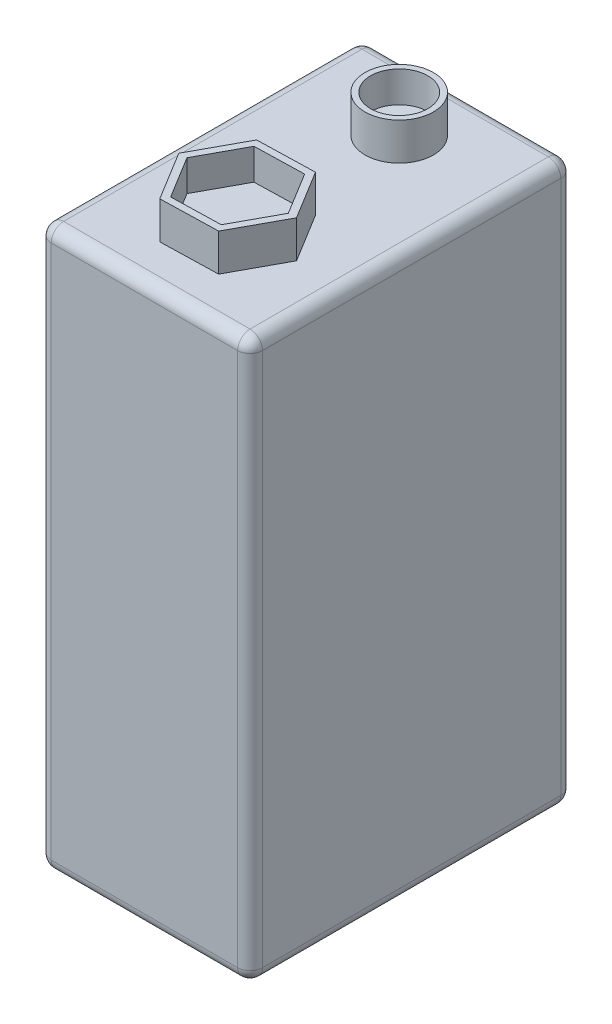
ISO-10303-21;
HEADER;
FILE_DESCRIPTION(('STEP AP214'),'2;1');
FILE_NAME('part.step','',(''),(''),'','','');
FILE_SCHEMA(('AUTOMOTIVE_DESIGN { 1 0 10303 214 1 1 1 1 }'));
ENDSEC;
DATA;
#1=APPLICATION_CONTEXT('core data for automotive mechanical design processes');
#2=APPLICATION_PROTOCOL_DEFINITION('international standard','automotive_design',2000,#1);
#3=PRODUCT_CONTEXT('',#1,'mechanical');
#4=PRODUCT('Part','Part','',(#3));
#5=PRODUCT_RELATED_PRODUCT_CATEGORY('part','',(#4));
#6=PRODUCT_DEFINITION_FORMATION('','',#4);
#7=PRODUCT_DEFINITION_CONTEXT('part definition',#1,'design');
#8=PRODUCT_DEFINITION('design','',#6,#7);
#9=PRODUCT_DEFINITION_SHAPE('','',#8);
#10=(LENGTH_UNIT() NAMED_UNIT(*) SI_UNIT(.MILLI.,.METRE.));
#11=(NAMED_UNIT(*) PLANE_ANGLE_UNIT() SI_UNIT($,.RADIAN.));
#12=(NAMED_UNIT(*) SI_UNIT($,.STERADIAN.) SOLID_ANGLE_UNIT());
#13=UNCERTAINTY_MEASURE_WITH_UNIT(LENGTH_MEASURE(1.E-05),#10,'distance_accuracy_value','');
#14=(GEOMETRIC_REPRESENTATION_CONTEXT(3) GLOBAL_UNCERTAINTY_ASSIGNED_CONTEXT((#13)) GLOBAL_UNIT_ASSIGNED_CONTEXT((#10,
#11,#12)) REPRESENTATION_CONTEXT('',''));
#15=CARTESIAN_POINT('',(0.,0.,0.));
#16=DIRECTION('',(0.,0.,1.));
#17=DIRECTION('',(1.,0.,0.));
#18=AXIS2_PLACEMENT_3D('',#15,#16,#17);
#19=CARTESIAN_POINT('',(0.,45.,26.));
#20=DIRECTION('',(0.,1.,0.));
#21=DIRECTION('',(0.,0.,1.));
#22=AXIS2_PLACEMENT_3D('',#19,#20,#21);
#23=PLANE('',#22);
#24=CARTESIAN_POINT('',(8.5,45.,5.5));
#25=DIRECTION('',(0.,1.,0.));
#26=DIRECTION('',(0.,0.,1.));
#27=AXIS2_PLACEMENT_3D('',#24,#25,#26);
#28=CIRCLE('',#27,2.75);
#29=CARTESIAN_POINT('',(8.5,45.,8.25));
#30=VERTEX_POINT('',#29);
#31=EDGE_CURVE('E292',#30,#30,#28,.T.);
#32=ORIENTED_EDGE('',*,*,#31,.F.);
#33=EDGE_LOOP('',(#32));
#34=FACE_BOUND('',#33,.T.);
#35=DIRECTION('',(1.,0.,0.));
#36=VECTOR('',#35,1.);
#37=CARTESIAN_POINT('',(16.,45.,25.));
#38=LINE('',#37,#36);
#39=CARTESIAN_POINT('',(1.,45.,25.));
#40=VERTEX_POINT('',#39);
#41=CARTESIAN_POINT('',(16.,45.,25.));
#42=VERTEX_POINT('',#41);
#43=EDGE_CURVE('E399',#40,#42,#38,.T.);
#44=ORIENTED_EDGE('',*,*,#43,.T.);
#45=DIRECTION('',(0.,0.,-1.));
#46=VECTOR('',#45,1.);
#47=CARTESIAN_POINT('',(16.,45.,1.));
#48=LINE('',#47,#46);
#49=CARTESIAN_POINT('',(16.,45.,1.));
#50=VERTEX_POINT('',#49);
#51=EDGE_CURVE('E401',#42,#50,#48,.T.);
#52=ORIENTED_EDGE('',*,*,#51,.T.);
#53=DIRECTION('',(-1.,0.,0.));
#54=VECTOR('',#53,1.);
#55=CARTESIAN_POINT('',(1.,45.,1.));
#56=LINE('',#55,#54);
#57=CARTESIAN_POINT('',(1.,45.,1.));
#58=VERTEX_POINT('',#57);
#59=EDGE_CURVE('E395',#50,#58,#56,.T.);
#60=ORIENTED_EDGE('',*,*,#59,.T.);
#61=DIRECTION('',(0.,0.,1.));
#62=VECTOR('',#61,1.);
#63=CARTESIAN_POINT('',(1.,45.,25.));
#64=LINE('',#63,#62);
#65=EDGE_CURVE('E397',#58,#40,#64,.T.);
#66=ORIENTED_EDGE('',*,*,#65,.T.);
#67=EDGE_LOOP('',(#44,#52,#60,#66));
#68=FACE_BOUND('',#67,.T.);
#69=DIRECTION('',(0.477175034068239,0.,-0.878808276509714));
#70=VECTOR('',#69,1.);
#71=CARTESIAN_POINT('',(10.9132445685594,45.,22.4382209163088));
#72=LINE('',#71,#70);
#73=CARTESIAN_POINT('',(10.9132445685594,45.,22.4382209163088));
#74=VERTEX_POINT('',#73);
#75=CARTESIAN_POINT('',(13.1172216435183,45.,18.3791793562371));
#76=VERTEX_POINT('',#75);
#77=EDGE_CURVE('E254',#74,#76,#72,.T.);
#78=ORIENTED_EDGE('',*,*,#77,.F.);
#79=DIRECTION('',(0.999657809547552,0.,-0.0261584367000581));
#80=VECTOR('',#79,1.);
#81=CARTESIAN_POINT('',(6.29602292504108,45.,22.5590415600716));
#82=LINE('',#81,#80);
#83=CARTESIAN_POINT('',(6.29602292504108,45.,22.5590415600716));
#84=VERTEX_POINT('',#83);
#85=EDGE_CURVE('E245',#84,#74,#82,.T.);
#86=ORIENTED_EDGE('',*,*,#85,.F.);
#87=DIRECTION('',(0.522482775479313,0.,0.852649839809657));
#88=VECTOR('',#87,1.);
#89=CARTESIAN_POINT('',(3.88277835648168,45.,18.6208206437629));
#90=LINE('',#89,#88);
#91=CARTESIAN_POINT('',(3.88277835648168,45.,18.6208206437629));
#92=VERTEX_POINT('',#91);
#93=EDGE_CURVE('E262',#92,#84,#90,.T.);
#94=ORIENTED_EDGE('',*,*,#93,.F.);
#95=DIRECTION('',(-0.477175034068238,0.,0.878808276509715));
#96=VECTOR('',#95,1.);
#97=CARTESIAN_POINT('',(6.08675543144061,45.,14.5617790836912));
#98=LINE('',#97,#96);
#99=CARTESIAN_POINT('',(6.08675543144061,45.,14.5617790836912));
#100=VERTEX_POINT('',#99);
#101=EDGE_CURVE('E260',#100,#92,#98,.T.);
#102=ORIENTED_EDGE('',*,*,#101,.F.);
#103=DIRECTION('',(-0.999657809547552,0.,0.0261584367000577));
#104=VECTOR('',#103,1.);
#105=CARTESIAN_POINT('',(10.7039770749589,45.,14.4409584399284));
#106=LINE('',#105,#104);
#107=CARTESIAN_POINT('',(10.7039770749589,45.,14.4409584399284));
#108=VERTEX_POINT('',#107);
#109=EDGE_CURVE('E258',#108,#100,#106,.T.);
#110=ORIENTED_EDGE('',*,*,#109,.F.);
#111=DIRECTION('',(-0.522482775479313,0.,-0.852649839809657));
#112=VECTOR('',#111,1.);
#113=CARTESIAN_POINT('',(13.1172216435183,45.,18.3791793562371));
#114=LINE('',#113,#112);
#115=EDGE_CURVE('E256',#76,#108,#114,.T.);
#116=ORIENTED_EDGE('',*,*,#115,.F.);
#117=EDGE_LOOP('',(#78,#86,#94,#102,#110,#116));
#118=FACE_BOUND('',#117,.T.);
#119=ADVANCED_FACE('F33',(#34,#68,#118),#23,.T.);
#120=CARTESIAN_POINT('',(0.,45.,0.));
#121=DIRECTION('',(1.,0.,0.));
#122=DIRECTION('',(0.,0.,-1.));
#123=AXIS2_PLACEMENT_3D('',#120,#121,#122);
#124=PLANE('',#123);
#125=DIRECTION('',(0.,-1.,0.));
#126=VECTOR('',#125,1.);
#127=CARTESIAN_POINT('',(0.,45.,25.));
#128=LINE('',#127,#126);
#129=CARTESIAN_POINT('',(0.,1.,25.));
#130=VERTEX_POINT('',#129);
#131=CARTESIAN_POINT('',(0.,44.,25.));
#132=VERTEX_POINT('',#131);
#133=EDGE_CURVE('E348',#130,#132,#128,.F.);
#134=ORIENTED_EDGE('',*,*,#133,.T.);
#135=DIRECTION('',(0.,0.,1.));
#136=VECTOR('',#135,1.);
#137=CARTESIAN_POINT('',(0.,44.,1.));
#138=LINE('',#137,#136);
#139=CARTESIAN_POINT('',(0.,44.,1.));
#140=VERTEX_POINT('',#139);
#141=EDGE_CURVE('E412',#132,#140,#138,.F.);
#142=ORIENTED_EDGE('',*,*,#141,.T.);
#143=DIRECTION('',(0.,-1.,0.));
#144=VECTOR('',#143,1.);
#145=CARTESIAN_POINT('',(0.,45.,1.));
#146=LINE('',#145,#144);
#147=CARTESIAN_POINT('',(0.,1.,1.));
#148=VERTEX_POINT('',#147);
#149=EDGE_CURVE('E358',#140,#148,#146,.T.);
#150=ORIENTED_EDGE('',*,*,#149,.T.);
#151=DIRECTION('',(0.,0.,1.));
#152=VECTOR('',#151,1.);
#153=CARTESIAN_POINT('',(0.,1.,0.));
#154=LINE('',#153,#152);
#155=EDGE_CURVE('E390',#148,#130,#154,.T.);
#156=ORIENTED_EDGE('',*,*,#155,.T.);
#157=EDGE_LOOP('',(#134,#142,#150,#156));
#158=FACE_BOUND('',#157,.T.);
#159=ADVANCED_FACE('F35',(#158),#124,.F.);
#160=CARTESIAN_POINT('',(0.,45.,26.));
#161=DIRECTION('',(0.,0.,-1.));
#162=DIRECTION('',(-1.,0.,0.));
#163=AXIS2_PLACEMENT_3D('',#160,#161,#162);
#164=PLANE('',#163);
#165=DIRECTION('',(0.,-1.,0.));
#166=VECTOR('',#165,1.);
#167=CARTESIAN_POINT('',(16.,45.,26.));
#168=LINE('',#167,#166);
#169=CARTESIAN_POINT('',(16.,1.,26.));
#170=VERTEX_POINT('',#169);
#171=CARTESIAN_POINT('',(16.,44.,26.));
#172=VERTEX_POINT('',#171);
#173=EDGE_CURVE('E343',#170,#172,#168,.F.);
#174=ORIENTED_EDGE('',*,*,#173,.T.);
#175=DIRECTION('',(1.,0.,0.));
#176=VECTOR('',#175,1.);
#177=CARTESIAN_POINT('',(1.,44.,26.));
#178=LINE('',#177,#176);
#179=CARTESIAN_POINT('',(1.,44.,26.));
#180=VERTEX_POINT('',#179);
#181=EDGE_CURVE('E408',#172,#180,#178,.F.);
#182=ORIENTED_EDGE('',*,*,#181,.T.);
#183=DIRECTION('',(0.,-1.,0.));
#184=VECTOR('',#183,1.);
#185=CARTESIAN_POINT('',(1.,45.,26.));
#186=LINE('',#185,#184);
#187=CARTESIAN_POINT('',(1.,1.,26.));
#188=VERTEX_POINT('',#187);
#189=EDGE_CURVE('E346',#180,#188,#186,.T.);
#190=ORIENTED_EDGE('',*,*,#189,.T.);
#191=DIRECTION('',(1.,0.,0.));
#192=VECTOR('',#191,1.);
#193=CARTESIAN_POINT('',(0.,1.,26.));
#194=LINE('',#193,#192);
#195=EDGE_CURVE('E366',#188,#170,#194,.T.);
#196=ORIENTED_EDGE('',*,*,#195,.T.);
#197=EDGE_LOOP('',(#174,#182,#190,#196));
#198=FACE_BOUND('',#197,.T.);
#199=ADVANCED_FACE('F486',(#198),#164,.F.);
#200=CARTESIAN_POINT('',(17.,45.,0.));
#201=DIRECTION('',(-1.,0.,0.));
#202=DIRECTION('',(0.,0.,1.));
#203=AXIS2_PLACEMENT_3D('',#200,#201,#202);
#204=PLANE('',#203);
#205=DIRECTION('',(0.,-1.,0.));
#206=VECTOR('',#205,1.);
#207=CARTESIAN_POINT('',(17.,45.,1.));
#208=LINE('',#207,#206);
#209=CARTESIAN_POINT('',(17.,1.,1.));
#210=VERTEX_POINT('',#209);
#211=CARTESIAN_POINT('',(17.,44.,1.));
#212=VERTEX_POINT('',#211);
#213=EDGE_CURVE('E351',#210,#212,#208,.F.);
#214=ORIENTED_EDGE('',*,*,#213,.T.);
#215=DIRECTION('',(0.,0.,-1.));
#216=VECTOR('',#215,1.);
#217=CARTESIAN_POINT('',(17.,44.,25.));
#218=LINE('',#217,#216);
#219=CARTESIAN_POINT('',(17.,44.,25.));
#220=VERTEX_POINT('',#219);
#221=EDGE_CURVE('E404',#212,#220,#218,.F.);
#222=ORIENTED_EDGE('',*,*,#221,.T.);
#223=DIRECTION('',(0.,-1.,0.));
#224=VECTOR('',#223,1.);
#225=CARTESIAN_POINT('',(17.,45.,25.));
#226=LINE('',#225,#224);
#227=CARTESIAN_POINT('',(17.,1.,25.));
#228=VERTEX_POINT('',#227);
#229=EDGE_CURVE('E354',#220,#228,#226,.T.);
#230=ORIENTED_EDGE('',*,*,#229,.T.);
#231=DIRECTION('',(0.,0.,-1.));
#232=VECTOR('',#231,1.);
#233=CARTESIAN_POINT('',(17.,1.,0.));
#234=LINE('',#233,#232);
#235=EDGE_CURVE('E380',#228,#210,#234,.T.);
#236=ORIENTED_EDGE('',*,*,#235,.T.);
#237=EDGE_LOOP('',(#214,#222,#230,#236));
#238=FACE_BOUND('',#237,.T.);
#239=ADVANCED_FACE('F447',(#238),#204,.F.);
#240=CARTESIAN_POINT('',(0.,45.,0.));
#241=DIRECTION('',(0.,0.,1.));
#242=DIRECTION('',(1.,0.,0.));
#243=AXIS2_PLACEMENT_3D('',#240,#241,#242);
#244=PLANE('',#243);
#245=DIRECTION('',(0.,-1.,0.));
#246=VECTOR('',#245,1.);
#247=CARTESIAN_POINT('',(1.,45.,0.));
#248=LINE('',#247,#246);
#249=CARTESIAN_POINT('',(1.,1.,0.));
#250=VERTEX_POINT('',#249);
#251=CARTESIAN_POINT('',(1.,44.,0.));
#252=VERTEX_POINT('',#251);
#253=EDGE_CURVE('E360',#250,#252,#248,.F.);
#254=ORIENTED_EDGE('',*,*,#253,.T.);
#255=DIRECTION('',(-1.,0.,0.));
#256=VECTOR('',#255,1.);
#257=CARTESIAN_POINT('',(16.,44.,0.));
#258=LINE('',#257,#256);
#259=CARTESIAN_POINT('',(16.,44.,0.));
#260=VERTEX_POINT('',#259);
#261=EDGE_CURVE('E11',#252,#260,#258,.F.);
#262=ORIENTED_EDGE('',*,*,#261,.T.);
#263=DIRECTION('',(0.,-1.,0.));
#264=VECTOR('',#263,1.);
#265=CARTESIAN_POINT('',(16.,45.,0.));
#266=LINE('',#265,#264);
#267=CARTESIAN_POINT('',(16.,1.,0.));
#268=VERTEX_POINT('',#267);
#269=EDGE_CURVE('E356',#260,#268,#266,.T.);
#270=ORIENTED_EDGE('',*,*,#269,.T.);
#271=DIRECTION('',(-1.,0.,0.));
#272=VECTOR('',#271,1.);
#273=CARTESIAN_POINT('',(0.,1.,0.));
#274=LINE('',#273,#272);
#275=EDGE_CURVE('E385',#268,#250,#274,.T.);
#276=ORIENTED_EDGE('',*,*,#275,.T.);
#277=EDGE_LOOP('',(#254,#262,#270,#276));
#278=FACE_BOUND('',#277,.T.);
#279=ADVANCED_FACE('F423',(#278),#244,.F.);
#280=CARTESIAN_POINT('',(0.,0.,26.));
#281=DIRECTION('',(0.,1.,0.));
#282=DIRECTION('',(0.,0.,1.));
#283=AXIS2_PLACEMENT_3D('',#280,#281,#282);
#284=PLANE('',#283);
#285=DIRECTION('',(0.,0.,-1.));
#286=VECTOR('',#285,1.);
#287=CARTESIAN_POINT('',(16.,0.,26.));
#288=LINE('',#287,#286);
#289=CARTESIAN_POINT('',(16.,0.,1.));
#290=VERTEX_POINT('',#289);
#291=CARTESIAN_POINT('',(16.,0.,25.));
#292=VERTEX_POINT('',#291);
#293=EDGE_CURVE('E372',#290,#292,#288,.F.);
#294=ORIENTED_EDGE('',*,*,#293,.T.);
#295=DIRECTION('',(1.,0.,0.));
#296=VECTOR('',#295,1.);
#297=CARTESIAN_POINT('',(0.,0.,25.));
#298=LINE('',#297,#296);
#299=CARTESIAN_POINT('',(1.,0.,25.));
#300=VERTEX_POINT('',#299);
#301=EDGE_CURVE('E374',#292,#300,#298,.F.);
#302=ORIENTED_EDGE('',*,*,#301,.T.);
#303=DIRECTION('',(0.,0.,1.));
#304=VECTOR('',#303,1.);
#305=CARTESIAN_POINT('',(1.,0.,26.));
#306=LINE('',#305,#304);
#307=CARTESIAN_POINT('',(1.,0.,1.));
#308=VERTEX_POINT('',#307);
#309=EDGE_CURVE('E368',#300,#308,#306,.F.);
#310=ORIENTED_EDGE('',*,*,#309,.T.);
#311=DIRECTION('',(-1.,0.,0.));
#312=VECTOR('',#311,1.);
#313=CARTESIAN_POINT('',(0.,0.,1.));
#314=LINE('',#313,#312);
#315=EDGE_CURVE('E370',#308,#290,#314,.F.);
#316=ORIENTED_EDGE('',*,*,#315,.T.);
#317=EDGE_LOOP('',(#294,#302,#310,#316));
#318=FACE_BOUND('',#317,.T.);
#319=ADVANCED_FACE('F465',(#318),#284,.F.);
#320=CARTESIAN_POINT('',(1.,45.,25.));
#321=DIRECTION('',(0.,-1.,0.));
#322=DIRECTION('',(0.,0.,-1.));
#323=AXIS2_PLACEMENT_3D('',#320,#321,#322);
#324=CYLINDRICAL_SURFACE('',#323,1.);
#325=ORIENTED_EDGE('',*,*,#189,.F.);
#326=CARTESIAN_POINT('',(1.,44.,25.));
#327=DIRECTION('',(0.,-1.,0.));
#328=DIRECTION('',(0.,0.,-1.));
#329=AXIS2_PLACEMENT_3D('',#326,#327,#328);
#330=CIRCLE('',#329,1.);
#331=EDGE_CURVE('E410',#180,#132,#330,.T.);
#332=ORIENTED_EDGE('',*,*,#331,.T.);
#333=ORIENTED_EDGE('',*,*,#133,.F.);
#334=CARTESIAN_POINT('',(1.,1.,25.));
#335=DIRECTION('',(0.,-1.,0.));
#336=DIRECTION('',(0.,0.,-1.));
#337=AXIS2_PLACEMENT_3D('',#334,#335,#336);
#338=CIRCLE('',#337,1.);
#339=EDGE_CURVE('E363',#130,#188,#338,.F.);
#340=ORIENTED_EDGE('',*,*,#339,.T.);
#341=EDGE_LOOP('',(#325,#332,#333,#340));
#342=FACE_BOUND('',#341,.T.);
#343=ADVANCED_FACE('F514',(#342),#324,.T.);
#344=CARTESIAN_POINT('',(16.,45.,25.));
#345=DIRECTION('',(0.,-1.,0.));
#346=DIRECTION('',(0.,0.,-1.));
#347=AXIS2_PLACEMENT_3D('',#344,#345,#346);
#348=CYLINDRICAL_SURFACE('',#347,1.);
#349=ORIENTED_EDGE('',*,*,#229,.F.);
#350=CARTESIAN_POINT('',(16.,44.,25.));
#351=DIRECTION('',(0.,-1.,0.));
#352=DIRECTION('',(0.,0.,-1.));
#353=AXIS2_PLACEMENT_3D('',#350,#351,#352);
#354=CIRCLE('',#353,1.);
#355=EDGE_CURVE('E406',#220,#172,#354,.T.);
#356=ORIENTED_EDGE('',*,*,#355,.T.);
#357=ORIENTED_EDGE('',*,*,#173,.F.);
#358=CARTESIAN_POINT('',(16.,1.,25.));
#359=DIRECTION('',(0.,-1.,0.));
#360=DIRECTION('',(0.,0.,-1.));
#361=AXIS2_PLACEMENT_3D('',#358,#359,#360);
#362=CIRCLE('',#361,1.);
#363=EDGE_CURVE('E377',#170,#228,#362,.F.);
#364=ORIENTED_EDGE('',*,*,#363,.T.);
#365=EDGE_LOOP('',(#349,#356,#357,#364));
#366=FACE_BOUND('',#365,.T.);
#367=ADVANCED_FACE('F513',(#366),#348,.T.);
#368=CARTESIAN_POINT('',(16.,45.,1.));
#369=DIRECTION('',(0.,-1.,0.));
#370=DIRECTION('',(0.,0.,-1.));
#371=AXIS2_PLACEMENT_3D('',#368,#369,#370);
#372=CYLINDRICAL_SURFACE('',#371,1.);
#373=ORIENTED_EDGE('',*,*,#269,.F.);
#374=CARTESIAN_POINT('',(16.,44.,1.));
#375=DIRECTION('',(0.,-1.,0.));
#376=DIRECTION('',(0.,0.,-1.));
#377=AXIS2_PLACEMENT_3D('',#374,#375,#376);
#378=CIRCLE('',#377,1.);
#379=EDGE_CURVE('E392',#260,#212,#378,.T.);
#380=ORIENTED_EDGE('',*,*,#379,.T.);
#381=ORIENTED_EDGE('',*,*,#213,.F.);
#382=CARTESIAN_POINT('',(16.,1.,1.));
#383=DIRECTION('',(0.,-1.,0.));
#384=DIRECTION('',(0.,0.,-1.));
#385=AXIS2_PLACEMENT_3D('',#382,#383,#384);
#386=CIRCLE('',#385,1.);
#387=EDGE_CURVE('E382',#210,#268,#386,.F.);
#388=ORIENTED_EDGE('',*,*,#387,.T.);
#389=EDGE_LOOP('',(#373,#380,#381,#388));
#390=FACE_BOUND('',#389,.T.);
#391=ADVANCED_FACE('F445',(#390),#372,.T.);
#392=CARTESIAN_POINT('',(1.,45.,1.));
#393=DIRECTION('',(0.,-1.,0.));
#394=DIRECTION('',(0.,0.,-1.));
#395=AXIS2_PLACEMENT_3D('',#392,#393,#394);
#396=CYLINDRICAL_SURFACE('',#395,1.);
#397=ORIENTED_EDGE('',*,*,#149,.F.);
#398=CARTESIAN_POINT('',(1.,44.,1.));
#399=DIRECTION('',(0.,-1.,0.));
#400=DIRECTION('',(0.,0.,-1.));
#401=AXIS2_PLACEMENT_3D('',#398,#399,#400);
#402=CIRCLE('',#401,1.);
#403=EDGE_CURVE('E41',#140,#252,#402,.T.);
#404=ORIENTED_EDGE('',*,*,#403,.T.);
#405=ORIENTED_EDGE('',*,*,#253,.F.);
#406=CARTESIAN_POINT('',(1.,1.,1.));
#407=DIRECTION('',(0.,-1.,0.));
#408=DIRECTION('',(0.,0.,-1.));
#409=AXIS2_PLACEMENT_3D('',#406,#407,#408);
#410=CIRCLE('',#409,1.);
#411=EDGE_CURVE('E387',#250,#148,#410,.F.);
#412=ORIENTED_EDGE('',*,*,#411,.T.);
#413=EDGE_LOOP('',(#397,#404,#405,#412));
#414=FACE_BOUND('',#413,.T.);
#415=ADVANCED_FACE('F417',(#414),#396,.T.);
#416=CARTESIAN_POINT('',(16.,1.,1.));
#417=DIRECTION('',(0.,0.,1.));
#418=DIRECTION('',(1.,0.,0.));
#419=AXIS2_PLACEMENT_3D('',#416,#417,#418);
#420=SPHERICAL_SURFACE('',#419,1.);
#421=CARTESIAN_POINT('',(16.,1.,1.));
#422=DIRECTION('',(-1.,0.,0.));
#423=DIRECTION('',(0.,0.,1.));
#424=AXIS2_PLACEMENT_3D('',#421,#422,#423);
#425=CIRCLE('',#424,1.);
#426=EDGE_CURVE('E337',#268,#290,#425,.T.);
#427=ORIENTED_EDGE('',*,*,#426,.F.);
#428=ORIENTED_EDGE('',*,*,#387,.F.);
#429=CARTESIAN_POINT('',(16.,1.,1.));
#430=DIRECTION('',(0.,0.,1.));
#431=DIRECTION('',(1.,0.,0.));
#432=AXIS2_PLACEMENT_3D('',#429,#430,#431);
#433=CIRCLE('',#432,1.);
#434=EDGE_CURVE('E340',#290,#210,#433,.T.);
#435=ORIENTED_EDGE('',*,*,#434,.F.);
#436=EDGE_LOOP('',(#427,#428,#435));
#437=FACE_BOUND('',#436,.T.);
#438=ADVANCED_FACE('F471',(#437),#420,.T.);
#439=CARTESIAN_POINT('',(16.,1.,0.));
#440=DIRECTION('',(0.,0.,-1.));
#441=DIRECTION('',(-1.,0.,0.));
#442=AXIS2_PLACEMENT_3D('',#439,#440,#441);
#443=CYLINDRICAL_SURFACE('',#442,1.);
#444=ORIENTED_EDGE('',*,*,#434,.T.);
#445=ORIENTED_EDGE('',*,*,#235,.F.);
#446=CARTESIAN_POINT('',(16.,1.,25.));
#447=DIRECTION('',(0.,0.,1.));
#448=DIRECTION('',(1.,0.,0.));
#449=AXIS2_PLACEMENT_3D('',#446,#447,#448);
#450=CIRCLE('',#449,1.);
#451=EDGE_CURVE('E334',#292,#228,#450,.T.);
#452=ORIENTED_EDGE('',*,*,#451,.F.);
#453=ORIENTED_EDGE('',*,*,#293,.F.);
#454=EDGE_LOOP('',(#444,#445,#452,#453));
#455=FACE_BOUND('',#454,.T.);
#456=ADVANCED_FACE('F451',(#455),#443,.T.);
#457=CARTESIAN_POINT('',(0.,1.,1.));
#458=DIRECTION('',(-1.,0.,0.));
#459=DIRECTION('',(0.,0.,1.));
#460=AXIS2_PLACEMENT_3D('',#457,#458,#459);
#461=CYLINDRICAL_SURFACE('',#460,1.);
#462=ORIENTED_EDGE('',*,*,#426,.T.);
#463=ORIENTED_EDGE('',*,*,#315,.F.);
#464=CARTESIAN_POINT('',(1.,1.,1.));
#465=DIRECTION('',(-1.,0.,0.));
#466=DIRECTION('',(0.,0.,1.));
#467=AXIS2_PLACEMENT_3D('',#464,#465,#466);
#468=CIRCLE('',#467,1.);
#469=EDGE_CURVE('E331',#250,#308,#468,.T.);
#470=ORIENTED_EDGE('',*,*,#469,.F.);
#471=ORIENTED_EDGE('',*,*,#275,.F.);
#472=EDGE_LOOP('',(#462,#463,#470,#471));
#473=FACE_BOUND('',#472,.T.);
#474=ADVANCED_FACE('F469',(#473),#461,.T.);
#475=CARTESIAN_POINT('',(16.,1.,25.));
#476=DIRECTION('',(0.,0.,1.));
#477=DIRECTION('',(1.,0.,0.));
#478=AXIS2_PLACEMENT_3D('',#475,#476,#477);
#479=SPHERICAL_SURFACE('',#478,1.);
#480=ORIENTED_EDGE('',*,*,#451,.T.);
#481=ORIENTED_EDGE('',*,*,#363,.F.);
#482=CARTESIAN_POINT('',(16.,1.,25.));
#483=DIRECTION('',(-1.,0.,0.));
#484=DIRECTION('',(0.,0.,1.));
#485=AXIS2_PLACEMENT_3D('',#482,#483,#484);
#486=CIRCLE('',#485,1.);
#487=EDGE_CURVE('E328',#292,#170,#486,.T.);
#488=ORIENTED_EDGE('',*,*,#487,.F.);
#489=EDGE_LOOP('',(#480,#481,#488));
#490=FACE_BOUND('',#489,.T.);
#491=ADVANCED_FACE('F457',(#490),#479,.T.);
#492=CARTESIAN_POINT('',(1.,1.,1.));
#493=DIRECTION('',(0.,0.,1.));
#494=DIRECTION('',(1.,0.,0.));
#495=AXIS2_PLACEMENT_3D('',#492,#493,#494);
#496=SPHERICAL_SURFACE('',#495,1.);
#497=ORIENTED_EDGE('',*,*,#411,.F.);
#498=ORIENTED_EDGE('',*,*,#469,.T.);
#499=CARTESIAN_POINT('',(1.,1.,1.));
#500=DIRECTION('',(0.,0.,1.));
#501=DIRECTION('',(1.,0.,0.));
#502=AXIS2_PLACEMENT_3D('',#499,#500,#501);
#503=CIRCLE('',#502,1.);
#504=EDGE_CURVE('E325',#148,#308,#503,.T.);
#505=ORIENTED_EDGE('',*,*,#504,.F.);
#506=EDGE_LOOP('',(#497,#498,#505));
#507=FACE_BOUND('',#506,.T.);
#508=ADVANCED_FACE('F544',(#507),#496,.T.);
#509=CARTESIAN_POINT('',(0.,1.,25.));
#510=DIRECTION('',(1.,0.,0.));
#511=DIRECTION('',(0.,0.,-1.));
#512=AXIS2_PLACEMENT_3D('',#509,#510,#511);
#513=CYLINDRICAL_SURFACE('',#512,1.);
#514=ORIENTED_EDGE('',*,*,#487,.T.);
#515=ORIENTED_EDGE('',*,*,#195,.F.);
#516=CARTESIAN_POINT('',(1.,1.,25.));
#517=DIRECTION('',(-1.,0.,0.));
#518=DIRECTION('',(0.,0.,1.));
#519=AXIS2_PLACEMENT_3D('',#516,#517,#518);
#520=CIRCLE('',#519,1.);
#521=EDGE_CURVE('E322',#300,#188,#520,.T.);
#522=ORIENTED_EDGE('',*,*,#521,.F.);
#523=ORIENTED_EDGE('',*,*,#301,.F.);
#524=EDGE_LOOP('',(#514,#515,#522,#523));
#525=FACE_BOUND('',#524,.T.);
#526=ADVANCED_FACE('F462',(#525),#513,.T.);
#527=CARTESIAN_POINT('',(1.,1.,0.));
#528=DIRECTION('',(0.,0.,1.));
#529=DIRECTION('',(1.,0.,0.));
#530=AXIS2_PLACEMENT_3D('',#527,#528,#529);
#531=CYLINDRICAL_SURFACE('',#530,1.);
#532=ORIENTED_EDGE('',*,*,#504,.T.);
#533=ORIENTED_EDGE('',*,*,#309,.F.);
#534=CARTESIAN_POINT('',(1.,1.,25.));
#535=DIRECTION('',(0.,0.,1.));
#536=DIRECTION('',(1.,0.,0.));
#537=AXIS2_PLACEMENT_3D('',#534,#535,#536);
#538=CIRCLE('',#537,1.);
#539=EDGE_CURVE('E320',#130,#300,#538,.T.);
#540=ORIENTED_EDGE('',*,*,#539,.F.);
#541=ORIENTED_EDGE('',*,*,#155,.F.);
#542=EDGE_LOOP('',(#532,#533,#540,#541));
#543=FACE_BOUND('',#542,.T.);
#544=ADVANCED_FACE('F540',(#543),#531,.T.);
#545=CARTESIAN_POINT('',(1.,1.,25.));
#546=DIRECTION('',(0.,0.,1.));
#547=DIRECTION('',(1.,0.,0.));
#548=AXIS2_PLACEMENT_3D('',#545,#546,#547);
#549=SPHERICAL_SURFACE('',#548,1.);
#550=ORIENTED_EDGE('',*,*,#521,.T.);
#551=ORIENTED_EDGE('',*,*,#339,.F.);
#552=ORIENTED_EDGE('',*,*,#539,.T.);
#553=EDGE_LOOP('',(#550,#551,#552));
#554=FACE_BOUND('',#553,.T.);
#555=ADVANCED_FACE('F538',(#554),#549,.T.);
#556=CARTESIAN_POINT('',(1.,44.,25.));
#557=DIRECTION('',(0.,0.,1.));
#558=DIRECTION('',(1.,0.,0.));
#559=AXIS2_PLACEMENT_3D('',#556,#557,#558);
#560=SPHERICAL_SURFACE('',#559,1.);
#561=CARTESIAN_POINT('',(1.,44.,25.));
#562=DIRECTION('',(0.,0.,-1.));
#563=DIRECTION('',(-1.,0.,0.));
#564=AXIS2_PLACEMENT_3D('',#561,#562,#563);
#565=CIRCLE('',#564,1.);
#566=EDGE_CURVE('E314',#132,#40,#565,.T.);
#567=ORIENTED_EDGE('',*,*,#566,.F.);
#568=ORIENTED_EDGE('',*,*,#331,.F.);
#569=CARTESIAN_POINT('',(1.,44.,25.));
#570=DIRECTION('',(1.,0.,0.));
#571=DIRECTION('',(0.,0.,-1.));
#572=AXIS2_PLACEMENT_3D('',#569,#570,#571);
#573=CIRCLE('',#572,1.);
#574=EDGE_CURVE('E317',#40,#180,#573,.T.);
#575=ORIENTED_EDGE('',*,*,#574,.F.);
#576=EDGE_LOOP('',(#567,#568,#575));
#577=FACE_BOUND('',#576,.T.);
#578=ADVANCED_FACE('F530',(#577),#560,.T.);
#579=CARTESIAN_POINT('',(0.,44.,25.));
#580=DIRECTION('',(-1.,0.,0.));
#581=DIRECTION('',(0.,0.,1.));
#582=AXIS2_PLACEMENT_3D('',#579,#580,#581);
#583=CYLINDRICAL_SURFACE('',#582,1.);
#584=ORIENTED_EDGE('',*,*,#574,.T.);
#585=ORIENTED_EDGE('',*,*,#181,.F.);
#586=CARTESIAN_POINT('',(16.,44.,25.));
#587=DIRECTION('',(1.,0.,0.));
#588=DIRECTION('',(0.,0.,-1.));
#589=AXIS2_PLACEMENT_3D('',#586,#587,#588);
#590=CIRCLE('',#589,1.);
#591=EDGE_CURVE('E311',#42,#172,#590,.T.);
#592=ORIENTED_EDGE('',*,*,#591,.F.);
#593=ORIENTED_EDGE('',*,*,#43,.F.);
#594=EDGE_LOOP('',(#584,#585,#592,#593));
#595=FACE_BOUND('',#594,.T.);
#596=ADVANCED_FACE('F507',(#595),#583,.T.);
#597=CARTESIAN_POINT('',(1.,44.,26.));
#598=DIRECTION('',(0.,0.,-1.));
#599=DIRECTION('',(-1.,0.,0.));
#600=AXIS2_PLACEMENT_3D('',#597,#598,#599);
#601=CYLINDRICAL_SURFACE('',#600,1.);
#602=ORIENTED_EDGE('',*,*,#566,.T.);
#603=ORIENTED_EDGE('',*,*,#65,.F.);
#604=CARTESIAN_POINT('',(1.,44.,1.));
#605=DIRECTION('',(0.,0.,-1.));
#606=DIRECTION('',(-1.,0.,0.));
#607=AXIS2_PLACEMENT_3D('',#604,#605,#606);
#608=CIRCLE('',#607,1.);
#609=EDGE_CURVE('E308',#140,#58,#608,.T.);
#610=ORIENTED_EDGE('',*,*,#609,.F.);
#611=ORIENTED_EDGE('',*,*,#141,.F.);
#612=EDGE_LOOP('',(#602,#603,#610,#611));
#613=FACE_BOUND('',#612,.T.);
#614=ADVANCED_FACE('F534',(#613),#601,.T.);
#615=CARTESIAN_POINT('',(16.,44.,25.));
#616=DIRECTION('',(0.,0.,1.));
#617=DIRECTION('',(1.,0.,0.));
#618=AXIS2_PLACEMENT_3D('',#615,#616,#617);
#619=SPHERICAL_SURFACE('',#618,1.);
#620=ORIENTED_EDGE('',*,*,#591,.T.);
#621=ORIENTED_EDGE('',*,*,#355,.F.);
#622=CARTESIAN_POINT('',(16.,44.,25.));
#623=DIRECTION('',(0.,0.,-1.));
#624=DIRECTION('',(-1.,0.,0.));
#625=AXIS2_PLACEMENT_3D('',#622,#623,#624);
#626=CIRCLE('',#625,1.);
#627=EDGE_CURVE('E305',#42,#220,#626,.T.);
#628=ORIENTED_EDGE('',*,*,#627,.F.);
#629=EDGE_LOOP('',(#620,#621,#628));
#630=FACE_BOUND('',#629,.T.);
#631=ADVANCED_FACE('F512',(#630),#619,.T.);
#632=CARTESIAN_POINT('',(1.,44.,1.));
#633=DIRECTION('',(0.,0.,1.));
#634=DIRECTION('',(1.,0.,0.));
#635=AXIS2_PLACEMENT_3D('',#632,#633,#634);
#636=SPHERICAL_SURFACE('',#635,1.);
#637=ORIENTED_EDGE('',*,*,#403,.F.);
#638=ORIENTED_EDGE('',*,*,#609,.T.);
#639=CARTESIAN_POINT('',(1.,44.,1.));
#640=DIRECTION('',(1.,0.,0.));
#641=DIRECTION('',(0.,0.,-1.));
#642=AXIS2_PLACEMENT_3D('',#639,#640,#641);
#643=CIRCLE('',#642,1.);
#644=EDGE_CURVE('E302',#252,#58,#643,.T.);
#645=ORIENTED_EDGE('',*,*,#644,.F.);
#646=EDGE_LOOP('',(#637,#638,#645));
#647=FACE_BOUND('',#646,.T.);
#648=ADVANCED_FACE('F427',(#647),#636,.T.);
#649=CARTESIAN_POINT('',(16.,44.,26.));
#650=DIRECTION('',(0.,0.,1.));
#651=DIRECTION('',(1.,0.,0.));
#652=AXIS2_PLACEMENT_3D('',#649,#650,#651);
#653=CYLINDRICAL_SURFACE('',#652,1.);
#654=ORIENTED_EDGE('',*,*,#627,.T.);
#655=ORIENTED_EDGE('',*,*,#221,.F.);
#656=CARTESIAN_POINT('',(16.,44.,1.));
#657=DIRECTION('',(0.,0.,-1.));
#658=DIRECTION('',(-1.,0.,0.));
#659=AXIS2_PLACEMENT_3D('',#656,#657,#658);
#660=CIRCLE('',#659,1.);
#661=EDGE_CURVE('E300',#50,#212,#660,.T.);
#662=ORIENTED_EDGE('',*,*,#661,.F.);
#663=ORIENTED_EDGE('',*,*,#51,.F.);
#664=EDGE_LOOP('',(#654,#655,#662,#663));
#665=FACE_BOUND('',#664,.T.);
#666=ADVANCED_FACE('F439',(#665),#653,.T.);
#667=CARTESIAN_POINT('',(0.,44.,1.));
#668=DIRECTION('',(1.,0.,0.));
#669=DIRECTION('',(0.,0.,-1.));
#670=AXIS2_PLACEMENT_3D('',#667,#668,#669);
#671=CYLINDRICAL_SURFACE('',#670,1.);
#672=ORIENTED_EDGE('',*,*,#644,.T.);
#673=ORIENTED_EDGE('',*,*,#59,.F.);
#674=CARTESIAN_POINT('',(16.,44.,1.));
#675=DIRECTION('',(1.,0.,0.));
#676=DIRECTION('',(0.,0.,-1.));
#677=AXIS2_PLACEMENT_3D('',#674,#675,#676);
#678=CIRCLE('',#677,1.);
#679=EDGE_CURVE('E298',#260,#50,#678,.T.);
#680=ORIENTED_EDGE('',*,*,#679,.F.);
#681=ORIENTED_EDGE('',*,*,#261,.F.);
#682=EDGE_LOOP('',(#672,#673,#680,#681));
#683=FACE_BOUND('',#682,.T.);
#684=ADVANCED_FACE('F431',(#683),#671,.T.);
#685=CARTESIAN_POINT('',(16.,44.,1.));
#686=DIRECTION('',(0.,0.,1.));
#687=DIRECTION('',(1.,0.,0.));
#688=AXIS2_PLACEMENT_3D('',#685,#686,#687);
#689=SPHERICAL_SURFACE('',#688,1.);
#690=ORIENTED_EDGE('',*,*,#661,.T.);
#691=ORIENTED_EDGE('',*,*,#379,.F.);
#692=ORIENTED_EDGE('',*,*,#679,.T.);
#693=EDGE_LOOP('',(#690,#691,#692));
#694=FACE_BOUND('',#693,.T.);
#695=ADVANCED_FACE('F435',(#694),#689,.T.);
#696=CARTESIAN_POINT('',(8.5,48.,5.5));
#697=DIRECTION('',(0.,-1.,0.));
#698=DIRECTION('',(0.,0.,-1.));
#699=AXIS2_PLACEMENT_3D('',#696,#697,#698);
#700=CYLINDRICAL_SURFACE('',#699,2.75);
#701=CARTESIAN_POINT('',(8.5,48.,5.5));
#702=DIRECTION('',(0.,1.,0.));
#703=DIRECTION('',(0.,0.,1.));
#704=AXIS2_PLACEMENT_3D('',#701,#702,#703);
#705=CIRCLE('',#704,2.75);
#706=CARTESIAN_POINT('',(8.5,48.,8.25));
#707=VERTEX_POINT('',#706);
#708=EDGE_CURVE('E295',#707,#707,#705,.T.);
#709=ORIENTED_EDGE('',*,*,#708,.F.);
#710=EDGE_LOOP('',(#709));
#711=FACE_BOUND('',#710,.T.);
#712=ORIENTED_EDGE('',*,*,#31,.T.);
#713=EDGE_LOOP('',(#712));
#714=FACE_BOUND('',#713,.T.);
#715=ADVANCED_FACE('F599',(#711,#714),#700,.T.);
#716=CARTESIAN_POINT('',(8.5,48.,5.5));
#717=DIRECTION('',(0.,1.,0.));
#718=DIRECTION('',(0.,0.,1.));
#719=AXIS2_PLACEMENT_3D('',#716,#717,#718);
#720=PLANE('',#719);
#721=CARTESIAN_POINT('',(8.5,48.,5.5));
#722=DIRECTION('',(0.,1.,0.));
#723=DIRECTION('',(0.,0.,1.));
#724=AXIS2_PLACEMENT_3D('',#721,#722,#723);
#725=CIRCLE('',#724,2.3);
#726=CARTESIAN_POINT('',(8.5,48.,7.8));
#727=VERTEX_POINT('',#726);
#728=EDGE_CURVE('E702',#727,#727,#725,.T.);
#729=ORIENTED_EDGE('',*,*,#728,.F.);
#730=EDGE_LOOP('',(#729));
#731=FACE_BOUND('',#730,.T.);
#732=ORIENTED_EDGE('',*,*,#708,.T.);
#733=EDGE_LOOP('',(#732));
#734=FACE_BOUND('',#733,.T.);
#735=ADVANCED_FACE('F604',(#731,#734),#720,.T.);
#736=CARTESIAN_POINT('',(6.29602292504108,48.,22.5590415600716));
#737=DIRECTION('',(-0.0261584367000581,0.,-0.999657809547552));
#738=DIRECTION('',(-0.999657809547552,0.,0.0261584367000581));
#739=AXIS2_PLACEMENT_3D('',#736,#737,#738);
#740=PLANE('',#739);
#741=ORIENTED_EDGE('',*,*,#85,.T.);
#742=DIRECTION('',(0.,-1.,0.));
#743=VECTOR('',#742,1.);
#744=CARTESIAN_POINT('',(10.9132445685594,48.,22.4382209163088));
#745=LINE('',#744,#743);
#746=CARTESIAN_POINT('',(10.9132445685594,48.,22.4382209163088));
#747=VERTEX_POINT('',#746);
#748=EDGE_CURVE('E290',#747,#74,#745,.T.);
#749=ORIENTED_EDGE('',*,*,#748,.F.);
#750=DIRECTION('',(0.999657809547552,0.,-0.0261584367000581));
#751=VECTOR('',#750,1.);
#752=CARTESIAN_POINT('',(6.29602292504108,48.,22.5590415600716));
#753=LINE('',#752,#751);
#754=CARTESIAN_POINT('',(6.29602292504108,48.,22.5590415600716));
#755=VERTEX_POINT('',#754);
#756=EDGE_CURVE('E264',#755,#747,#753,.T.);
#757=ORIENTED_EDGE('',*,*,#756,.F.);
#758=DIRECTION('',(0.,-1.,0.));
#759=VECTOR('',#758,1.);
#760=CARTESIAN_POINT('',(6.29602292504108,48.,22.5590415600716));
#761=LINE('',#760,#759);
#762=EDGE_CURVE('E277',#755,#84,#761,.T.);
#763=ORIENTED_EDGE('',*,*,#762,.T.);
#764=EDGE_LOOP('',(#741,#749,#757,#763));
#765=FACE_BOUND('',#764,.T.);
#766=ADVANCED_FACE('F610',(#765),#740,.F.);
#767=CARTESIAN_POINT('',(10.9132445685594,48.,22.4382209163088));
#768=DIRECTION('',(-0.878808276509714,0.,-0.477175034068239));
#769=DIRECTION('',(-0.477175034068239,0.,0.878808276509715));
#770=AXIS2_PLACEMENT_3D('',#767,#768,#769);
#771=PLANE('',#770);
#772=ORIENTED_EDGE('',*,*,#77,.T.);
#773=DIRECTION('',(0.,-1.,0.));
#774=VECTOR('',#773,1.);
#775=CARTESIAN_POINT('',(13.1172216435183,48.,18.3791793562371));
#776=LINE('',#775,#774);
#777=CARTESIAN_POINT('',(13.1172216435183,48.,18.3791793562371));
#778=VERTEX_POINT('',#777);
#779=EDGE_CURVE('E287',#778,#76,#776,.T.);
#780=ORIENTED_EDGE('',*,*,#779,.F.);
#781=DIRECTION('',(0.477175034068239,0.,-0.878808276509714));
#782=VECTOR('',#781,1.);
#783=CARTESIAN_POINT('',(10.9132445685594,48.,22.4382209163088));
#784=LINE('',#783,#782);
#785=EDGE_CURVE('E267',#747,#778,#784,.T.);
#786=ORIENTED_EDGE('',*,*,#785,.F.);
#787=ORIENTED_EDGE('',*,*,#748,.T.);
#788=EDGE_LOOP('',(#772,#780,#786,#787));
#789=FACE_BOUND('',#788,.T.);
#790=ADVANCED_FACE('F616',(#789),#771,.F.);
#791=CARTESIAN_POINT('',(13.1172216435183,48.,18.3791793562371));
#792=DIRECTION('',(-0.852649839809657,0.,0.522482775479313));
#793=DIRECTION('',(0.522482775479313,0.,0.852649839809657));
#794=AXIS2_PLACEMENT_3D('',#791,#792,#793);
#795=PLANE('',#794);
#796=ORIENTED_EDGE('',*,*,#115,.T.);
#797=DIRECTION('',(0.,-1.,0.));
#798=VECTOR('',#797,1.);
#799=CARTESIAN_POINT('',(10.7039770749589,48.,14.4409584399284));
#800=LINE('',#799,#798);
#801=CARTESIAN_POINT('',(10.7039770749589,48.,14.4409584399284));
#802=VERTEX_POINT('',#801);
#803=EDGE_CURVE('E284',#802,#108,#800,.T.);
#804=ORIENTED_EDGE('',*,*,#803,.F.);
#805=DIRECTION('',(-0.522482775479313,0.,-0.852649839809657));
#806=VECTOR('',#805,1.);
#807=CARTESIAN_POINT('',(13.1172216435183,48.,18.3791793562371));
#808=LINE('',#807,#806);
#809=EDGE_CURVE('E269',#778,#802,#808,.T.);
#810=ORIENTED_EDGE('',*,*,#809,.F.);
#811=ORIENTED_EDGE('',*,*,#779,.T.);
#812=EDGE_LOOP('',(#796,#804,#810,#811));
#813=FACE_BOUND('',#812,.T.);
#814=ADVANCED_FACE('F622',(#813),#795,.F.);
#815=CARTESIAN_POINT('',(10.7039770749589,48.,14.4409584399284));
#816=DIRECTION('',(0.0261584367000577,0.,0.999657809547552));
#817=DIRECTION('',(0.999657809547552,0.,-0.0261584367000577));
#818=AXIS2_PLACEMENT_3D('',#815,#816,#817);
#819=PLANE('',#818);
#820=ORIENTED_EDGE('',*,*,#109,.T.);
#821=DIRECTION('',(0.,-1.,0.));
#822=VECTOR('',#821,1.);
#823=CARTESIAN_POINT('',(6.08675543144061,48.,14.5617790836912));
#824=LINE('',#823,#822);
#825=CARTESIAN_POINT('',(6.08675543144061,48.,14.5617790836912));
#826=VERTEX_POINT('',#825);
#827=EDGE_CURVE('E281',#826,#100,#824,.T.);
#828=ORIENTED_EDGE('',*,*,#827,.F.);
#829=DIRECTION('',(-0.999657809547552,0.,0.0261584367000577));
#830=VECTOR('',#829,1.);
#831=CARTESIAN_POINT('',(10.7039770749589,48.,14.4409584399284));
#832=LINE('',#831,#830);
#833=EDGE_CURVE('E271',#802,#826,#832,.T.);
#834=ORIENTED_EDGE('',*,*,#833,.F.);
#835=ORIENTED_EDGE('',*,*,#803,.T.);
#836=EDGE_LOOP('',(#820,#828,#834,#835));
#837=FACE_BOUND('',#836,.T.);
#838=ADVANCED_FACE('F628',(#837),#819,.F.);
#839=CARTESIAN_POINT('',(6.08675543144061,48.,14.5617790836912));
#840=DIRECTION('',(0.878808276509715,0.,0.477175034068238));
#841=DIRECTION('',(0.477175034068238,0.,-0.878808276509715));
#842=AXIS2_PLACEMENT_3D('',#839,#840,#841);
#843=PLANE('',#842);
#844=ORIENTED_EDGE('',*,*,#101,.T.);
#845=DIRECTION('',(0.,-1.,0.));
#846=VECTOR('',#845,1.);
#847=CARTESIAN_POINT('',(3.88277835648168,48.,18.6208206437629));
#848=LINE('',#847,#846);
#849=CARTESIAN_POINT('',(3.88277835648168,48.,18.6208206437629));
#850=VERTEX_POINT('',#849);
#851=EDGE_CURVE('E56',#850,#92,#848,.T.);
#852=ORIENTED_EDGE('',*,*,#851,.F.);
#853=DIRECTION('',(-0.477175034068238,0.,0.878808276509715));
#854=VECTOR('',#853,1.);
#855=CARTESIAN_POINT('',(6.08675543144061,48.,14.5617790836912));
#856=LINE('',#855,#854);
#857=EDGE_CURVE('E273',#826,#850,#856,.T.);
#858=ORIENTED_EDGE('',*,*,#857,.F.);
#859=ORIENTED_EDGE('',*,*,#827,.T.);
#860=EDGE_LOOP('',(#844,#852,#858,#859));
#861=FACE_BOUND('',#860,.T.);
#862=ADVANCED_FACE('F634',(#861),#843,.F.);
#863=CARTESIAN_POINT('',(3.88277835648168,48.,18.6208206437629));
#864=DIRECTION('',(0.852649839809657,0.,-0.522482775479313));
#865=DIRECTION('',(-0.522482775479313,0.,-0.852649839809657));
#866=AXIS2_PLACEMENT_3D('',#863,#864,#865);
#867=PLANE('',#866);
#868=ORIENTED_EDGE('',*,*,#93,.T.);
#869=ORIENTED_EDGE('',*,*,#762,.F.);
#870=DIRECTION('',(0.522482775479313,0.,0.852649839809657));
#871=VECTOR('',#870,1.);
#872=CARTESIAN_POINT('',(3.88277835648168,48.,18.6208206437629));
#873=LINE('',#872,#871);
#874=EDGE_CURVE('E275',#850,#755,#873,.T.);
#875=ORIENTED_EDGE('',*,*,#874,.F.);
#876=ORIENTED_EDGE('',*,*,#851,.T.);
#877=EDGE_LOOP('',(#868,#869,#875,#876));
#878=FACE_BOUND('',#877,.T.);
#879=ADVANCED_FACE('F640',(#878),#867,.F.);
#880=CARTESIAN_POINT('',(15.5304662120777,48.,22.3174002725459));
#881=DIRECTION('',(0.,1.,0.));
#882=DIRECTION('',(0.,0.,1.));
#883=AXIS2_PLACEMENT_3D('',#880,#881,#882);
#884=PLANE('',#883);
#885=DIRECTION('',(0.999657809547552,0.,-0.0261584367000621));
#886=VECTOR('',#885,1.);
#887=CARTESIAN_POINT('',(6.60350828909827,48.,21.9927489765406));
#888=LINE('',#887,#886);
#889=CARTESIAN_POINT('',(6.60350828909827,48.,21.9927489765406));
#890=VERTEX_POINT('',#889);
#891=CARTESIAN_POINT('',(10.5765634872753,48.,21.8887844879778));
#892=VERTEX_POINT('',#891);
#893=EDGE_CURVE('E48',#890,#892,#888,.T.);
#894=ORIENTED_EDGE('',*,*,#893,.F.);
#895=DIRECTION('',(0.522482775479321,0.,0.852649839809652));
#896=VECTOR('',#895,1.);
#897=CARTESIAN_POINT('',(4.5269448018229,48.,18.6039644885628));
#898=LINE('',#897,#896);
#899=CARTESIAN_POINT('',(4.5269448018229,48.,18.6039644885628));
#900=VERTEX_POINT('',#899);
#901=EDGE_CURVE('E225',#900,#890,#898,.T.);
#902=ORIENTED_EDGE('',*,*,#901,.F.);
#903=DIRECTION('',(-0.477175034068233,0.,0.878808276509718));
#904=VECTOR('',#903,1.);
#905=CARTESIAN_POINT('',(6.42343651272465,48.,15.1112155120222));
#906=LINE('',#905,#904);
#907=CARTESIAN_POINT('',(6.42343651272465,48.,15.1112155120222));
#908=VERTEX_POINT('',#907);
#909=EDGE_CURVE('E219',#908,#900,#906,.T.);
#910=ORIENTED_EDGE('',*,*,#909,.F.);
#911=DIRECTION('',(-0.999657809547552,0.,0.0261584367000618));
#912=VECTOR('',#911,1.);
#913=CARTESIAN_POINT('',(10.3964917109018,48.,15.0072510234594));
#914=LINE('',#913,#912);
#915=CARTESIAN_POINT('',(10.3964917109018,48.,15.0072510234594));
#916=VERTEX_POINT('',#915);
#917=EDGE_CURVE('E217',#916,#908,#914,.T.);
#918=ORIENTED_EDGE('',*,*,#917,.F.);
#919=DIRECTION('',(-0.522482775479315,0.,-0.852649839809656));
#920=VECTOR('',#919,1.);
#921=CARTESIAN_POINT('',(12.4730551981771,48.,18.3960355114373));
#922=LINE('',#921,#920);
#923=CARTESIAN_POINT('',(12.4730551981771,48.,18.3960355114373));
#924=VERTEX_POINT('',#923);
#925=EDGE_CURVE('E198',#924,#916,#922,.T.);
#926=ORIENTED_EDGE('',*,*,#925,.F.);
#927=DIRECTION('',(0.477175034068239,0.,-0.878808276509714));
#928=VECTOR('',#927,1.);
#929=CARTESIAN_POINT('',(10.5765634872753,48.,21.8887844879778));
#930=LINE('',#929,#928);
#931=EDGE_CURVE('E209',#892,#924,#930,.T.);
#932=ORIENTED_EDGE('',*,*,#931,.F.);
#933=EDGE_LOOP('',(#894,#902,#910,#918,#926,#932));
#934=FACE_BOUND('',#933,.T.);
#935=ORIENTED_EDGE('',*,*,#756,.T.);
#936=ORIENTED_EDGE('',*,*,#785,.T.);
#937=ORIENTED_EDGE('',*,*,#809,.T.);
#938=ORIENTED_EDGE('',*,*,#833,.T.);
#939=ORIENTED_EDGE('',*,*,#857,.T.);
#940=ORIENTED_EDGE('',*,*,#874,.T.);
#941=EDGE_LOOP('',(#935,#936,#937,#938,#939,#940));
#942=FACE_BOUND('',#941,.T.);
#943=ADVANCED_FACE('F213',(#934,#942),#884,.T.);
#944=CARTESIAN_POINT('',(6.60350828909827,45.5,21.9927489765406));
#945=DIRECTION('',(0.0261584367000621,0.,0.999657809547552));
#946=DIRECTION('',(0.999657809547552,0.,-0.0261584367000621));
#947=AXIS2_PLACEMENT_3D('',#944,#945,#946);
#948=PLANE('',#947);
#949=ORIENTED_EDGE('',*,*,#893,.T.);
#950=DIRECTION('',(0.,1.,0.));
#951=VECTOR('',#950,1.);
#952=CARTESIAN_POINT('',(10.5765634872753,45.5,21.8887844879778));
#953=LINE('',#952,#951);
#954=CARTESIAN_POINT('',(10.5765634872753,45.5,21.8887844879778));
#955=VERTEX_POINT('',#954);
#956=EDGE_CURVE('E206',#955,#892,#953,.T.);
#957=ORIENTED_EDGE('',*,*,#956,.F.);
#958=DIRECTION('',(0.999657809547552,0.,-0.0261584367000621));
#959=VECTOR('',#958,1.);
#960=CARTESIAN_POINT('',(6.60350828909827,45.5,21.9927489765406));
#961=LINE('',#960,#959);
#962=CARTESIAN_POINT('',(6.60350828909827,45.5,21.9927489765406));
#963=VERTEX_POINT('',#962);
#964=EDGE_CURVE('E228',#963,#955,#961,.T.);
#965=ORIENTED_EDGE('',*,*,#964,.F.);
#966=DIRECTION('',(0.,1.,0.));
#967=VECTOR('',#966,1.);
#968=CARTESIAN_POINT('',(6.60350828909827,45.5,21.9927489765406));
#969=LINE('',#968,#967);
#970=EDGE_CURVE('E243',#963,#890,#969,.T.);
#971=ORIENTED_EDGE('',*,*,#970,.T.);
#972=EDGE_LOOP('',(#949,#957,#965,#971));
#973=FACE_BOUND('',#972,.T.);
#974=ADVANCED_FACE('F650',(#973),#948,.F.);
#975=CARTESIAN_POINT('',(4.5269448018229,45.5,18.6039644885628));
#976=DIRECTION('',(-0.852649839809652,0.,0.522482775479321));
#977=DIRECTION('',(0.522482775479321,0.,0.852649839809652));
#978=AXIS2_PLACEMENT_3D('',#975,#976,#977);
#979=PLANE('',#978);
#980=ORIENTED_EDGE('',*,*,#901,.T.);
#981=ORIENTED_EDGE('',*,*,#970,.F.);
#982=DIRECTION('',(0.522482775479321,0.,0.852649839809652));
#983=VECTOR('',#982,1.);
#984=CARTESIAN_POINT('',(4.5269448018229,45.5,18.6039644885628));
#985=LINE('',#984,#983);
#986=CARTESIAN_POINT('',(4.5269448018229,45.5,18.6039644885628));
#987=VERTEX_POINT('',#986);
#988=EDGE_CURVE('E240',#987,#963,#985,.T.);
#989=ORIENTED_EDGE('',*,*,#988,.F.);
#990=DIRECTION('',(0.,1.,0.));
#991=VECTOR('',#990,1.);
#992=CARTESIAN_POINT('',(4.5269448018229,45.5,18.6039644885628));
#993=LINE('',#992,#991);
#994=EDGE_CURVE('E246',#987,#900,#993,.T.);
#995=ORIENTED_EDGE('',*,*,#994,.T.);
#996=EDGE_LOOP('',(#980,#981,#989,#995));
#997=FACE_BOUND('',#996,.T.);
#998=ADVANCED_FACE('F655',(#997),#979,.F.);
#999=CARTESIAN_POINT('',(6.42343651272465,45.5,15.1112155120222));
#1000=DIRECTION('',(-0.878808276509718,0.,-0.477175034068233));
#1001=DIRECTION('',(-0.477175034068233,0.,0.878808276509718));
#1002=AXIS2_PLACEMENT_3D('',#999,#1000,#1001);
#1003=PLANE('',#1002);
#1004=ORIENTED_EDGE('',*,*,#909,.T.);
#1005=ORIENTED_EDGE('',*,*,#994,.F.);
#1006=DIRECTION('',(-0.477175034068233,0.,0.878808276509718));
#1007=VECTOR('',#1006,1.);
#1008=CARTESIAN_POINT('',(6.42343651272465,45.5,15.1112155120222));
#1009=LINE('',#1008,#1007);
#1010=CARTESIAN_POINT('',(6.42343651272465,45.5,15.1112155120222));
#1011=VERTEX_POINT('',#1010);
#1012=EDGE_CURVE('E237',#1011,#987,#1009,.T.);
#1013=ORIENTED_EDGE('',*,*,#1012,.F.);
#1014=DIRECTION('',(0.,1.,0.));
#1015=VECTOR('',#1014,1.);
#1016=CARTESIAN_POINT('',(6.42343651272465,45.5,15.1112155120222));
#1017=LINE('',#1016,#1015);
#1018=EDGE_CURVE('E248',#1011,#908,#1017,.T.);
#1019=ORIENTED_EDGE('',*,*,#1018,.T.);
#1020=EDGE_LOOP('',(#1004,#1005,#1013,#1019));
#1021=FACE_BOUND('',#1020,.T.);
#1022=ADVANCED_FACE('F670',(#1021),#1003,.F.);
#1023=CARTESIAN_POINT('',(10.3964917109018,45.5,15.0072510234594));
#1024=DIRECTION('',(-0.0261584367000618,0.,-0.999657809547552));
#1025=DIRECTION('',(-0.999657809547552,0.,0.0261584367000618));
#1026=AXIS2_PLACEMENT_3D('',#1023,#1024,#1025);
#1027=PLANE('',#1026);
#1028=ORIENTED_EDGE('',*,*,#917,.T.);
#1029=ORIENTED_EDGE('',*,*,#1018,.F.);
#1030=DIRECTION('',(-0.999657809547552,0.,0.0261584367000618));
#1031=VECTOR('',#1030,1.);
#1032=CARTESIAN_POINT('',(10.3964917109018,45.5,15.0072510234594));
#1033=LINE('',#1032,#1031);
#1034=CARTESIAN_POINT('',(10.3964917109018,45.5,15.0072510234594));
#1035=VERTEX_POINT('',#1034);
#1036=EDGE_CURVE('E234',#1035,#1011,#1033,.T.);
#1037=ORIENTED_EDGE('',*,*,#1036,.F.);
#1038=DIRECTION('',(0.,1.,0.));
#1039=VECTOR('',#1038,1.);
#1040=CARTESIAN_POINT('',(10.3964917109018,45.5,15.0072510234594));
#1041=LINE('',#1040,#1039);
#1042=EDGE_CURVE('E205',#1035,#916,#1041,.T.);
#1043=ORIENTED_EDGE('',*,*,#1042,.T.);
#1044=EDGE_LOOP('',(#1028,#1029,#1037,#1043));
#1045=FACE_BOUND('',#1044,.T.);
#1046=ADVANCED_FACE('F665',(#1045),#1027,.F.);
#1047=CARTESIAN_POINT('',(12.4730551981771,45.5,18.3960355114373));
#1048=DIRECTION('',(0.852649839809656,0.,-0.522482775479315));
#1049=DIRECTION('',(-0.522482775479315,0.,-0.852649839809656));
#1050=AXIS2_PLACEMENT_3D('',#1047,#1048,#1049);
#1051=PLANE('',#1050);
#1052=ORIENTED_EDGE('',*,*,#925,.T.);
#1053=ORIENTED_EDGE('',*,*,#1042,.F.);
#1054=DIRECTION('',(-0.522482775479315,0.,-0.852649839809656));
#1055=VECTOR('',#1054,1.);
#1056=CARTESIAN_POINT('',(12.4730551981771,45.5,18.3960355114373));
#1057=LINE('',#1056,#1055);
#1058=CARTESIAN_POINT('',(12.4730551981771,45.5,18.3960355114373));
#1059=VERTEX_POINT('',#1058);
#1060=EDGE_CURVE('E201',#1059,#1035,#1057,.T.);
#1061=ORIENTED_EDGE('',*,*,#1060,.F.);
#1062=DIRECTION('',(0.,1.,0.));
#1063=VECTOR('',#1062,1.);
#1064=CARTESIAN_POINT('',(12.4730551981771,45.5,18.3960355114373));
#1065=LINE('',#1064,#1063);
#1066=EDGE_CURVE('E194',#1059,#924,#1065,.T.);
#1067=ORIENTED_EDGE('',*,*,#1066,.T.);
#1068=EDGE_LOOP('',(#1052,#1053,#1061,#1067));
#1069=FACE_BOUND('',#1068,.T.);
#1070=ADVANCED_FACE('F196',(#1069),#1051,.F.);
#1071=CARTESIAN_POINT('',(10.5765634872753,45.5,21.8887844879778));
#1072=DIRECTION('',(0.878808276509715,0.,0.477175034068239));
#1073=DIRECTION('',(0.477175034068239,0.,-0.878808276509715));
#1074=AXIS2_PLACEMENT_3D('',#1071,#1072,#1073);
#1075=PLANE('',#1074);
#1076=ORIENTED_EDGE('',*,*,#931,.T.);
#1077=ORIENTED_EDGE('',*,*,#1066,.F.);
#1078=DIRECTION('',(0.477175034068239,0.,-0.878808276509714));
#1079=VECTOR('',#1078,1.);
#1080=CARTESIAN_POINT('',(10.5765634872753,45.5,21.8887844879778));
#1081=LINE('',#1080,#1079);
#1082=EDGE_CURVE('E231',#955,#1059,#1081,.T.);
#1083=ORIENTED_EDGE('',*,*,#1082,.F.);
#1084=ORIENTED_EDGE('',*,*,#956,.T.);
#1085=EDGE_LOOP('',(#1076,#1077,#1083,#1084));
#1086=FACE_BOUND('',#1085,.T.);
#1087=ADVANCED_FACE('F210',(#1086),#1075,.F.);
#1088=CARTESIAN_POINT('',(2.63045309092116,45.5,22.0967134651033));
#1089=DIRECTION('',(0.,-1.,0.));
#1090=DIRECTION('',(0.,0.,-1.));
#1091=AXIS2_PLACEMENT_3D('',#1088,#1089,#1090);
#1092=PLANE('',#1091);
#1093=ORIENTED_EDGE('',*,*,#964,.T.);
#1094=ORIENTED_EDGE('',*,*,#1082,.T.);
#1095=ORIENTED_EDGE('',*,*,#1060,.T.);
#1096=ORIENTED_EDGE('',*,*,#1036,.T.);
#1097=ORIENTED_EDGE('',*,*,#1012,.T.);
#1098=ORIENTED_EDGE('',*,*,#988,.T.);
#1099=EDGE_LOOP('',(#1093,#1094,#1095,#1096,#1097,#1098));
#1100=FACE_BOUND('',#1099,.T.);
#1101=ADVANCED_FACE('F660',(#1100),#1092,.F.);
#1102=CARTESIAN_POINT('',(8.5,45.5,5.5));
#1103=DIRECTION('',(0.,1.,0.));
#1104=DIRECTION('',(0.,0.,1.));
#1105=AXIS2_PLACEMENT_3D('',#1102,#1103,#1104);
#1106=CYLINDRICAL_SURFACE('',#1105,2.3);
#1107=CARTESIAN_POINT('',(8.5,45.5,5.5));
#1108=DIRECTION('',(0.,1.,0.));
#1109=DIRECTION('',(0.,0.,1.));
#1110=AXIS2_PLACEMENT_3D('',#1107,#1108,#1109);
#1111=CIRCLE('',#1110,2.3);
#1112=CARTESIAN_POINT('',(8.5,45.5,7.8));
#1113=VERTEX_POINT('',#1112);
#1114=EDGE_CURVE('E701',#1113,#1113,#1111,.T.);
#1115=ORIENTED_EDGE('',*,*,#1114,.F.);
#1116=EDGE_LOOP('',(#1115));
#1117=FACE_BOUND('',#1116,.T.);
#1118=ORIENTED_EDGE('',*,*,#728,.T.);
#1119=EDGE_LOOP('',(#1118));
#1120=FACE_BOUND('',#1119,.T.);
#1121=ADVANCED_FACE('F686',(#1117,#1120),#1106,.F.);
#1122=CARTESIAN_POINT('',(8.5,45.5,5.5));
#1123=DIRECTION('',(0.,1.,0.));
#1124=DIRECTION('',(0.,0.,1.));
#1125=AXIS2_PLACEMENT_3D('',#1122,#1123,#1124);
#1126=PLANE('',#1125);
#1127=ORIENTED_EDGE('',*,*,#1114,.T.);
#1128=EDGE_LOOP('',(#1127));
#1129=FACE_BOUND('',#1128,.T.);
#1130=ADVANCED_FACE('F692',(#1129),#1126,.T.);
#1131=CLOSED_SHELL('',(#119,#159,#199,#239,#279,#319,#343,#367,#391,#415,#438,#456,#474,#491,
#508,#526,#544,#555,#578,#596,#614,#631,#648,#666,#684,#695,#715,#735,#766,#790,#814,#838,#862,
#879,#943,#974,#998,#1022,#1046,#1070,#1087,#1101,#1121,#1130));
#1132=MANIFOLD_SOLID_BREP('B2',#1131);
#1133=ADVANCED_BREP_SHAPE_REPRESENTATION('',(#18,#1132),#14);
#1134=SHAPE_DEFINITION_REPRESENTATION(#9,#1133);
ENDSEC;
END-ISO-10303-21;
